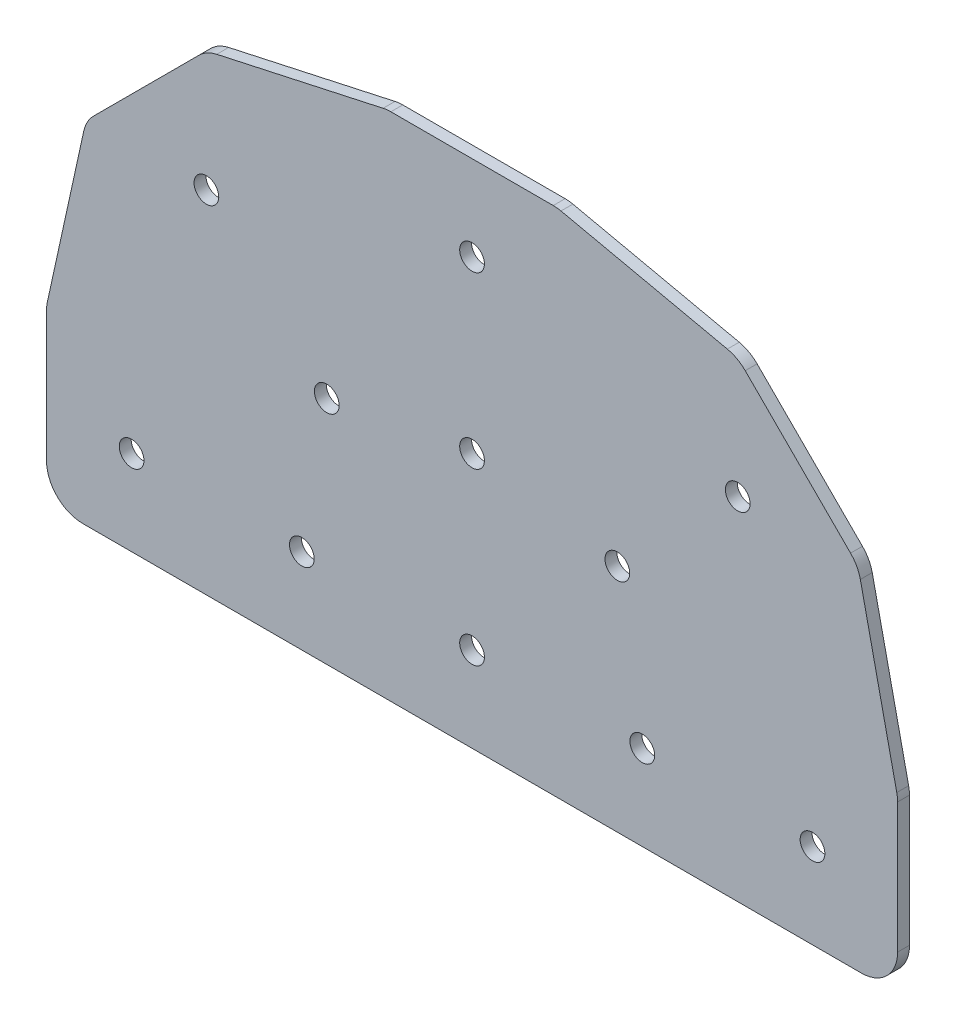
ISO-10303-21;
HEADER;
FILE_DESCRIPTION(('STEP AP214'),'2;1');
FILE_NAME('part.step','',(''),(''),'','','');
FILE_SCHEMA(('AUTOMOTIVE_DESIGN { 1 0 10303 214 1 1 1 1 }'));
ENDSEC;
DATA;
#1=APPLICATION_CONTEXT('core data for automotive mechanical design processes');
#2=APPLICATION_PROTOCOL_DEFINITION('international standard','automotive_design',2000,#1);
#3=PRODUCT_CONTEXT('',#1,'mechanical');
#4=PRODUCT('Part','Part','',(#3));
#5=PRODUCT_RELATED_PRODUCT_CATEGORY('part','',(#4));
#6=PRODUCT_DEFINITION_FORMATION('','',#4);
#7=PRODUCT_DEFINITION_CONTEXT('part definition',#1,'design');
#8=PRODUCT_DEFINITION('design','',#6,#7);
#9=PRODUCT_DEFINITION_SHAPE('','',#8);
#10=(LENGTH_UNIT() NAMED_UNIT(*) SI_UNIT(.MILLI.,.METRE.));
#11=(NAMED_UNIT(*) PLANE_ANGLE_UNIT() SI_UNIT($,.RADIAN.));
#12=(NAMED_UNIT(*) SI_UNIT($,.STERADIAN.) SOLID_ANGLE_UNIT());
#13=UNCERTAINTY_MEASURE_WITH_UNIT(LENGTH_MEASURE(1.E-05),#10,'distance_accuracy_value','');
#14=(GEOMETRIC_REPRESENTATION_CONTEXT(3) GLOBAL_UNCERTAINTY_ASSIGNED_CONTEXT((#13)) GLOBAL_UNIT_ASSIGNED_CONTEXT((#10,
#11,#12)) REPRESENTATION_CONTEXT('',''));
#15=CARTESIAN_POINT('',(0.,0.,0.));
#16=DIRECTION('',(0.,0.,1.));
#17=DIRECTION('',(1.,0.,0.));
#18=AXIS2_PLACEMENT_3D('',#15,#16,#17);
#19=CARTESIAN_POINT('',(56.8325,0.,0.));
#20=DIRECTION('',(0.,0.,1.));
#21=DIRECTION('',(1.,0.,0.));
#22=AXIS2_PLACEMENT_3D('',#19,#20,#21);
#23=PLANE('',#22);
#24=CARTESIAN_POINT('',(51.990625,4.841875,0.));
#25=DIRECTION('',(0.,0.,-1.));
#26=DIRECTION('',(-1.,0.,0.));
#27=AXIS2_PLACEMENT_3D('',#24,#25,#26);
#28=CIRCLE('',#27,4.841875);
#29=CARTESIAN_POINT('',(51.990625,0.,0.));
#30=VERTEX_POINT('',#29);
#31=CARTESIAN_POINT('',(56.8325,4.841875,0.));
#32=VERTEX_POINT('',#31);
#33=EDGE_CURVE('E158',#30,#32,#28,.F.);
#34=ORIENTED_EDGE('',*,*,#33,.F.);
#35=DIRECTION('',(1.,0.,0.));
#36=VECTOR('',#35,1.);
#37=CARTESIAN_POINT('',(-56.8325,0.,0.));
#38=LINE('',#37,#36);
#39=CARTESIAN_POINT('',(-51.990625,0.,0.));
#40=VERTEX_POINT('',#39);
#41=EDGE_CURVE('E150',#30,#40,#38,.F.);
#42=ORIENTED_EDGE('',*,*,#41,.T.);
#43=CARTESIAN_POINT('',(-51.990625,4.841875,0.));
#44=DIRECTION('',(0.,0.,-1.));
#45=DIRECTION('',(-1.,0.,0.));
#46=AXIS2_PLACEMENT_3D('',#43,#44,#45);
#47=CIRCLE('',#46,4.841875);
#48=CARTESIAN_POINT('',(-56.8325,4.841875,0.));
#49=VERTEX_POINT('',#48);
#50=EDGE_CURVE('E284',#49,#40,#47,.F.);
#51=ORIENTED_EDGE('',*,*,#50,.F.);
#52=DIRECTION('',(0.,1.,0.));
#53=VECTOR('',#52,1.);
#54=CARTESIAN_POINT('',(-56.8325,22.733,0.));
#55=LINE('',#54,#53);
#56=CARTESIAN_POINT('',(-56.8325,22.2091372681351,0.));
#57=VERTEX_POINT('',#56);
#58=EDGE_CURVE('E185',#49,#57,#55,.T.);
#59=ORIENTED_EDGE('',*,*,#58,.T.);
#60=CARTESIAN_POINT('',(-51.990625,22.2091372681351,0.));
#61=DIRECTION('',(0.,0.,-1.));
#62=DIRECTION('',(-1.,0.,0.));
#63=AXIS2_PLACEMENT_3D('',#60,#61,#62);
#64=CIRCLE('',#63,4.841875);
#65=CARTESIAN_POINT('',(-56.7204538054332,23.2447399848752,0.));
#66=VERTEX_POINT('',#65);
#67=EDGE_CURVE('E188',#66,#57,#64,.F.);
#68=ORIENTED_EDGE('',*,*,#67,.F.);
#69=DIRECTION('',(0.213884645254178,0.976858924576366,0.));
#70=VECTOR('',#69,1.);
#71=CARTESIAN_POINT('',(-51.5531461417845,46.8449876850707,0.));
#72=LINE('',#71,#70);
#73=CARTESIAN_POINT('',(-51.8564671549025,45.4596529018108,0.));
#74=VERTEX_POINT('',#73);
#75=EDGE_CURVE('E189',#66,#74,#72,.T.);
#76=ORIENTED_EDGE('',*,*,#75,.T.);
#77=CARTESIAN_POINT('',(-47.1266383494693,44.4240501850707,0.));
#78=DIRECTION('',(0.,0.,-1.));
#79=DIRECTION('',(-1.,0.,0.));
#80=AXIS2_PLACEMENT_3D('',#77,#78,#79);
#81=CIRCLE('',#80,4.841875);
#82=CARTESIAN_POINT('',(-50.5503609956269,47.8477728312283,0.));
#83=VERTEX_POINT('',#82);
#84=EDGE_CURVE('E192',#83,#74,#81,.F.);
#85=ORIENTED_EDGE('',*,*,#84,.F.);
#86=DIRECTION('',(0.707106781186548,0.707106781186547,0.));
#87=VECTOR('',#86,1.);
#88=CARTESIAN_POINT('',(-51.5531461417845,46.8449876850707,0.));
#89=LINE('',#88,#87);
#90=CARTESIAN_POINT('',(-36.4812728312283,61.9168609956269,0.));
#91=VERTEX_POINT('',#90);
#92=EDGE_CURVE('E193',#83,#91,#89,.T.);
#93=ORIENTED_EDGE('',*,*,#92,.T.);
#94=CARTESIAN_POINT('',(-33.0575501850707,58.4931383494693,0.));
#95=DIRECTION('',(0.,0.,-1.));
#96=DIRECTION('',(-1.,0.,0.));
#97=AXIS2_PLACEMENT_3D('',#94,#95,#96);
#98=CIRCLE('',#97,4.841875);
#99=CARTESIAN_POINT('',(-34.0931529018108,63.2229671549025,0.));
#100=VERTEX_POINT('',#99);
#101=EDGE_CURVE('E196',#100,#91,#98,.F.);
#102=ORIENTED_EDGE('',*,*,#101,.F.);
#103=DIRECTION('',(0.976858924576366,0.213884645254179,0.));
#104=VECTOR('',#103,1.);
#105=CARTESIAN_POINT('',(-35.4784876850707,62.9196461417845,0.));
#106=LINE('',#105,#104);
#107=CARTESIAN_POINT('',(-11.8782399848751,68.0869538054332,0.));
#108=VERTEX_POINT('',#107);
#109=EDGE_CURVE('E197',#100,#108,#106,.T.);
#110=ORIENTED_EDGE('',*,*,#109,.T.);
#111=CARTESIAN_POINT('',(-10.8426372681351,63.357125,0.));
#112=DIRECTION('',(0.,0.,-1.));
#113=DIRECTION('',(-1.,0.,0.));
#114=AXIS2_PLACEMENT_3D('',#111,#112,#113);
#115=CIRCLE('',#114,4.841875);
#116=CARTESIAN_POINT('',(-10.8426372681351,68.199,0.));
#117=VERTEX_POINT('',#116);
#118=EDGE_CURVE('E200',#117,#108,#115,.F.);
#119=ORIENTED_EDGE('',*,*,#118,.F.);
#120=DIRECTION('',(1.,0.,0.));
#121=VECTOR('',#120,1.);
#122=CARTESIAN_POINT('',(11.3665,68.199,0.));
#123=LINE('',#122,#121);
#124=CARTESIAN_POINT('',(10.8426372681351,68.199,0.));
#125=VERTEX_POINT('',#124);
#126=EDGE_CURVE('E201',#117,#125,#123,.T.);
#127=ORIENTED_EDGE('',*,*,#126,.T.);
#128=CARTESIAN_POINT('',(10.8426372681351,63.357125,0.));
#129=DIRECTION('',(0.,0.,-1.));
#130=DIRECTION('',(-1.,0.,0.));
#131=AXIS2_PLACEMENT_3D('',#128,#129,#130);
#132=CIRCLE('',#131,4.841875);
#133=CARTESIAN_POINT('',(11.8782399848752,68.0869538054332,0.));
#134=VERTEX_POINT('',#133);
#135=EDGE_CURVE('E204',#134,#125,#132,.F.);
#136=ORIENTED_EDGE('',*,*,#135,.F.);
#137=DIRECTION('',(0.976858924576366,-0.21388464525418,0.));
#138=VECTOR('',#137,1.);
#139=CARTESIAN_POINT('',(35.4784876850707,62.9196461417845,0.));
#140=LINE('',#139,#138);
#141=CARTESIAN_POINT('',(34.0931529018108,63.2229671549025,0.));
#142=VERTEX_POINT('',#141);
#143=EDGE_CURVE('E205',#134,#142,#140,.T.);
#144=ORIENTED_EDGE('',*,*,#143,.T.);
#145=CARTESIAN_POINT('',(33.0575501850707,58.4931383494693,0.));
#146=DIRECTION('',(0.,0.,-1.));
#147=DIRECTION('',(-1.,0.,0.));
#148=AXIS2_PLACEMENT_3D('',#145,#146,#147);
#149=CIRCLE('',#148,4.841875);
#150=CARTESIAN_POINT('',(36.4812728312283,61.9168609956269,0.));
#151=VERTEX_POINT('',#150);
#152=EDGE_CURVE('E208',#151,#142,#149,.F.);
#153=ORIENTED_EDGE('',*,*,#152,.F.);
#154=DIRECTION('',(0.707106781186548,-0.707106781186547,0.));
#155=VECTOR('',#154,1.);
#156=CARTESIAN_POINT('',(51.5531461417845,46.8449876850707,0.));
#157=LINE('',#156,#155);
#158=CARTESIAN_POINT('',(50.5503609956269,47.8477728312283,0.));
#159=VERTEX_POINT('',#158);
#160=EDGE_CURVE('E209',#151,#159,#157,.T.);
#161=ORIENTED_EDGE('',*,*,#160,.T.);
#162=CARTESIAN_POINT('',(47.1266383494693,44.4240501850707,0.));
#163=DIRECTION('',(0.,0.,-1.));
#164=DIRECTION('',(-1.,0.,0.));
#165=AXIS2_PLACEMENT_3D('',#162,#163,#164);
#166=CIRCLE('',#165,4.841875);
#167=CARTESIAN_POINT('',(51.8564671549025,45.4596529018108,0.));
#168=VERTEX_POINT('',#167);
#169=EDGE_CURVE('E212',#168,#159,#166,.F.);
#170=ORIENTED_EDGE('',*,*,#169,.F.);
#171=DIRECTION('',(0.213884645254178,-0.976858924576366,0.));
#172=VECTOR('',#171,1.);
#173=CARTESIAN_POINT('',(51.5531461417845,46.8449876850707,0.));
#174=LINE('',#173,#172);
#175=CARTESIAN_POINT('',(56.7204538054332,23.2447399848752,0.));
#176=VERTEX_POINT('',#175);
#177=EDGE_CURVE('E213',#168,#176,#174,.T.);
#178=ORIENTED_EDGE('',*,*,#177,.T.);
#179=CARTESIAN_POINT('',(51.990625,22.2091372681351,0.));
#180=DIRECTION('',(0.,0.,-1.));
#181=DIRECTION('',(-1.,0.,0.));
#182=AXIS2_PLACEMENT_3D('',#179,#180,#181);
#183=CIRCLE('',#182,4.841875);
#184=CARTESIAN_POINT('',(56.8325,22.2091372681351,0.));
#185=VERTEX_POINT('',#184);
#186=EDGE_CURVE('E161',#185,#176,#183,.F.);
#187=ORIENTED_EDGE('',*,*,#186,.F.);
#188=DIRECTION('',(0.,1.,0.));
#189=VECTOR('',#188,1.);
#190=CARTESIAN_POINT('',(56.8325,22.733,0.));
#191=LINE('',#190,#189);
#192=EDGE_CURVE('E155',#185,#32,#191,.F.);
#193=ORIENTED_EDGE('',*,*,#192,.T.);
#194=EDGE_LOOP('',(#34,#42,#51,#59,#68,#76,#85,#93,#102,#110,#119,#127,#136,#144,#153,#161,#170,
#178,#187,#193));
#195=FACE_BOUND('',#194,.T.);
#196=CARTESIAN_POINT('',(22.733,11.3665,0.));
#197=DIRECTION('',(0.,0.,1.));
#198=DIRECTION('',(1.,0.,0.));
#199=AXIS2_PLACEMENT_3D('',#196,#197,#198);
#200=CIRCLE('',#199,1.651);
#201=CARTESIAN_POINT('',(24.384,11.3665,0.));
#202=VERTEX_POINT('',#201);
#203=EDGE_CURVE('E184',#202,#202,#200,.T.);
#204=ORIENTED_EDGE('',*,*,#203,.T.);
#205=EDGE_LOOP('',(#204));
#206=FACE_BOUND('',#205,.T.);
#207=CARTESIAN_POINT('',(-22.733,11.3665,0.));
#208=DIRECTION('',(0.,0.,1.));
#209=DIRECTION('',(1.,0.,0.));
#210=AXIS2_PLACEMENT_3D('',#207,#208,#209);
#211=CIRCLE('',#210,1.651);
#212=CARTESIAN_POINT('',(-21.082,11.3665,0.));
#213=VERTEX_POINT('',#212);
#214=EDGE_CURVE('E311',#213,#213,#211,.T.);
#215=ORIENTED_EDGE('',*,*,#214,.T.);
#216=EDGE_LOOP('',(#215));
#217=FACE_BOUND('',#216,.T.);
#218=CARTESIAN_POINT('',(-19.4038292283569,30.770329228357,0.));
#219=DIRECTION('',(0.,0.,1.));
#220=DIRECTION('',(1.,0.,0.));
#221=AXIS2_PLACEMENT_3D('',#218,#219,#220);
#222=CIRCLE('',#221,1.651);
#223=CARTESIAN_POINT('',(-17.7528292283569,30.770329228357,0.));
#224=VERTEX_POINT('',#223);
#225=EDGE_CURVE('E314',#224,#224,#222,.T.);
#226=ORIENTED_EDGE('',*,*,#225,.T.);
#227=EDGE_LOOP('',(#226));
#228=FACE_BOUND('',#227,.T.);
#229=CARTESIAN_POINT('',(-35.4784876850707,46.8449876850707,0.));
#230=DIRECTION('',(0.,0.,1.));
#231=DIRECTION('',(1.,0.,0.));
#232=AXIS2_PLACEMENT_3D('',#229,#230,#231);
#233=CIRCLE('',#232,1.651);
#234=CARTESIAN_POINT('',(-33.8274876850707,46.8449876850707,0.));
#235=VERTEX_POINT('',#234);
#236=EDGE_CURVE('E317',#235,#235,#233,.T.);
#237=ORIENTED_EDGE('',*,*,#236,.T.);
#238=EDGE_LOOP('',(#237));
#239=FACE_BOUND('',#238,.T.);
#240=CARTESIAN_POINT('',(19.4038292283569,30.7703292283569,0.));
#241=DIRECTION('',(0.,0.,1.));
#242=DIRECTION('',(1.,0.,0.));
#243=AXIS2_PLACEMENT_3D('',#240,#241,#242);
#244=CIRCLE('',#243,1.651);
#245=CARTESIAN_POINT('',(21.0548292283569,30.7703292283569,0.));
#246=VERTEX_POINT('',#245);
#247=EDGE_CURVE('E320',#246,#246,#244,.T.);
#248=ORIENTED_EDGE('',*,*,#247,.T.);
#249=EDGE_LOOP('',(#248));
#250=FACE_BOUND('',#249,.T.);
#251=CARTESIAN_POINT('',(35.4784876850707,46.8449876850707,0.));
#252=DIRECTION('',(0.,0.,1.));
#253=DIRECTION('',(1.,0.,0.));
#254=AXIS2_PLACEMENT_3D('',#251,#252,#253);
#255=CIRCLE('',#254,1.651);
#256=CARTESIAN_POINT('',(37.1294876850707,46.8449876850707,0.));
#257=VERTEX_POINT('',#256);
#258=EDGE_CURVE('E323',#257,#257,#255,.T.);
#259=ORIENTED_EDGE('',*,*,#258,.T.);
#260=EDGE_LOOP('',(#259));
#261=FACE_BOUND('',#260,.T.);
#262=CARTESIAN_POINT('',(45.466,11.3665,0.));
#263=DIRECTION('',(0.,0.,1.));
#264=DIRECTION('',(1.,0.,0.));
#265=AXIS2_PLACEMENT_3D('',#262,#263,#264);
#266=CIRCLE('',#265,1.651);
#267=CARTESIAN_POINT('',(47.117,11.3665,0.));
#268=VERTEX_POINT('',#267);
#269=EDGE_CURVE('E326',#268,#268,#266,.T.);
#270=ORIENTED_EDGE('',*,*,#269,.T.);
#271=EDGE_LOOP('',(#270));
#272=FACE_BOUND('',#271,.T.);
#273=CARTESIAN_POINT('',(-45.466,11.3665,0.));
#274=DIRECTION('',(0.,0.,1.));
#275=DIRECTION('',(1.,0.,0.));
#276=AXIS2_PLACEMENT_3D('',#273,#274,#275);
#277=CIRCLE('',#276,1.651);
#278=CARTESIAN_POINT('',(-43.815,11.3665,0.));
#279=VERTEX_POINT('',#278);
#280=EDGE_CURVE('E329',#279,#279,#277,.T.);
#281=ORIENTED_EDGE('',*,*,#280,.T.);
#282=EDGE_LOOP('',(#281));
#283=FACE_BOUND('',#282,.T.);
#284=CARTESIAN_POINT('',(0.,34.0995,0.));
#285=DIRECTION('',(0.,0.,1.));
#286=DIRECTION('',(1.,0.,0.));
#287=AXIS2_PLACEMENT_3D('',#284,#285,#286);
#288=CIRCLE('',#287,1.651);
#289=CARTESIAN_POINT('',(1.65100000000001,34.0995,0.));
#290=VERTEX_POINT('',#289);
#291=EDGE_CURVE('E332',#290,#290,#288,.T.);
#292=ORIENTED_EDGE('',*,*,#291,.T.);
#293=EDGE_LOOP('',(#292));
#294=FACE_BOUND('',#293,.T.);
#295=CARTESIAN_POINT('',(0.,56.8325,0.));
#296=DIRECTION('',(0.,0.,1.));
#297=DIRECTION('',(1.,0.,0.));
#298=AXIS2_PLACEMENT_3D('',#295,#296,#297);
#299=CIRCLE('',#298,1.651);
#300=CARTESIAN_POINT('',(1.65100000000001,56.8325,0.));
#301=VERTEX_POINT('',#300);
#302=EDGE_CURVE('E334',#301,#301,#299,.T.);
#303=ORIENTED_EDGE('',*,*,#302,.T.);
#304=EDGE_LOOP('',(#303));
#305=FACE_BOUND('',#304,.T.);
#306=CARTESIAN_POINT('',(0.,11.3665,0.));
#307=DIRECTION('',(0.,0.,1.));
#308=DIRECTION('',(1.,0.,0.));
#309=AXIS2_PLACEMENT_3D('',#306,#307,#308);
#310=CIRCLE('',#309,1.651);
#311=CARTESIAN_POINT('',(1.65100000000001,11.3665,0.));
#312=VERTEX_POINT('',#311);
#313=EDGE_CURVE('E20',#312,#312,#310,.T.);
#314=ORIENTED_EDGE('',*,*,#313,.T.);
#315=EDGE_LOOP('',(#314));
#316=FACE_BOUND('',#315,.T.);
#317=ADVANCED_FACE('F17',(#195,#206,#217,#228,#239,#250,#261,#272,#283,#294,#305,#316),#23,.F.);
#318=CARTESIAN_POINT('',(0.,11.3665,1.5875));
#319=DIRECTION('',(0.,0.,1.));
#320=DIRECTION('',(1.,0.,0.));
#321=AXIS2_PLACEMENT_3D('',#318,#319,#320);
#322=CYLINDRICAL_SURFACE('',#321,1.651);
#323=CARTESIAN_POINT('',(0.,11.3665,1.5875));
#324=DIRECTION('',(0.,0.,1.));
#325=DIRECTION('',(1.,0.,0.));
#326=AXIS2_PLACEMENT_3D('',#323,#324,#325);
#327=CIRCLE('',#326,1.651);
#328=CARTESIAN_POINT('',(1.65100000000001,11.3665,1.5875));
#329=VERTEX_POINT('',#328);
#330=EDGE_CURVE('E280',#329,#329,#327,.F.);
#331=ORIENTED_EDGE('',*,*,#330,.F.);
#332=EDGE_LOOP('',(#331));
#333=FACE_BOUND('',#332,.T.);
#334=ORIENTED_EDGE('',*,*,#313,.F.);
#335=EDGE_LOOP('',(#334));
#336=FACE_BOUND('',#335,.T.);
#337=ADVANCED_FACE('F342',(#333,#336),#322,.F.);
#338=CARTESIAN_POINT('',(0.,56.8325,1.5875));
#339=DIRECTION('',(0.,0.,1.));
#340=DIRECTION('',(1.,0.,0.));
#341=AXIS2_PLACEMENT_3D('',#338,#339,#340);
#342=CYLINDRICAL_SURFACE('',#341,1.651);
#343=CARTESIAN_POINT('',(0.,56.8325,1.5875));
#344=DIRECTION('',(0.,0.,1.));
#345=DIRECTION('',(1.,0.,0.));
#346=AXIS2_PLACEMENT_3D('',#343,#344,#345);
#347=CIRCLE('',#346,1.651);
#348=CARTESIAN_POINT('',(1.65100000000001,56.8325,1.5875));
#349=VERTEX_POINT('',#348);
#350=EDGE_CURVE('E277',#349,#349,#347,.F.);
#351=ORIENTED_EDGE('',*,*,#350,.F.);
#352=EDGE_LOOP('',(#351));
#353=FACE_BOUND('',#352,.T.);
#354=ORIENTED_EDGE('',*,*,#302,.F.);
#355=EDGE_LOOP('',(#354));
#356=FACE_BOUND('',#355,.T.);
#357=ADVANCED_FACE('F344',(#353,#356),#342,.F.);
#358=CARTESIAN_POINT('',(0.,34.0995,1.5875));
#359=DIRECTION('',(0.,0.,1.));
#360=DIRECTION('',(1.,0.,0.));
#361=AXIS2_PLACEMENT_3D('',#358,#359,#360);
#362=CYLINDRICAL_SURFACE('',#361,1.651);
#363=CARTESIAN_POINT('',(0.,34.0995,1.5875));
#364=DIRECTION('',(0.,0.,1.));
#365=DIRECTION('',(1.,0.,0.));
#366=AXIS2_PLACEMENT_3D('',#363,#364,#365);
#367=CIRCLE('',#366,1.651);
#368=CARTESIAN_POINT('',(1.65100000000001,34.0995,1.5875));
#369=VERTEX_POINT('',#368);
#370=EDGE_CURVE('E274',#369,#369,#367,.F.);
#371=ORIENTED_EDGE('',*,*,#370,.F.);
#372=EDGE_LOOP('',(#371));
#373=FACE_BOUND('',#372,.T.);
#374=ORIENTED_EDGE('',*,*,#291,.F.);
#375=EDGE_LOOP('',(#374));
#376=FACE_BOUND('',#375,.T.);
#377=ADVANCED_FACE('F351',(#373,#376),#362,.F.);
#378=CARTESIAN_POINT('',(-45.466,11.3665,1.5875));
#379=DIRECTION('',(0.,0.,1.));
#380=DIRECTION('',(1.,0.,0.));
#381=AXIS2_PLACEMENT_3D('',#378,#379,#380);
#382=CYLINDRICAL_SURFACE('',#381,1.651);
#383=CARTESIAN_POINT('',(-45.466,11.3665,1.5875));
#384=DIRECTION('',(0.,0.,1.));
#385=DIRECTION('',(1.,0.,0.));
#386=AXIS2_PLACEMENT_3D('',#383,#384,#385);
#387=CIRCLE('',#386,1.651);
#388=CARTESIAN_POINT('',(-43.815,11.3665,1.5875));
#389=VERTEX_POINT('',#388);
#390=EDGE_CURVE('E271',#389,#389,#387,.F.);
#391=ORIENTED_EDGE('',*,*,#390,.F.);
#392=EDGE_LOOP('',(#391));
#393=FACE_BOUND('',#392,.T.);
#394=ORIENTED_EDGE('',*,*,#280,.F.);
#395=EDGE_LOOP('',(#394));
#396=FACE_BOUND('',#395,.T.);
#397=ADVANCED_FACE('F465',(#393,#396),#382,.F.);
#398=CARTESIAN_POINT('',(45.466,11.3665,1.5875));
#399=DIRECTION('',(0.,0.,1.));
#400=DIRECTION('',(1.,0.,0.));
#401=AXIS2_PLACEMENT_3D('',#398,#399,#400);
#402=CYLINDRICAL_SURFACE('',#401,1.651);
#403=CARTESIAN_POINT('',(45.466,11.3665,1.5875));
#404=DIRECTION('',(0.,0.,1.));
#405=DIRECTION('',(1.,0.,0.));
#406=AXIS2_PLACEMENT_3D('',#403,#404,#405);
#407=CIRCLE('',#406,1.651);
#408=CARTESIAN_POINT('',(47.117,11.3665,1.5875));
#409=VERTEX_POINT('',#408);
#410=EDGE_CURVE('E268',#409,#409,#407,.F.);
#411=ORIENTED_EDGE('',*,*,#410,.F.);
#412=EDGE_LOOP('',(#411));
#413=FACE_BOUND('',#412,.T.);
#414=ORIENTED_EDGE('',*,*,#269,.F.);
#415=EDGE_LOOP('',(#414));
#416=FACE_BOUND('',#415,.T.);
#417=ADVANCED_FACE('F461',(#413,#416),#402,.F.);
#418=CARTESIAN_POINT('',(35.4784876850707,46.8449876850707,1.5875));
#419=DIRECTION('',(0.,0.,1.));
#420=DIRECTION('',(1.,0.,0.));
#421=AXIS2_PLACEMENT_3D('',#418,#419,#420);
#422=CYLINDRICAL_SURFACE('',#421,1.651);
#423=CARTESIAN_POINT('',(35.4784876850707,46.8449876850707,1.5875));
#424=DIRECTION('',(0.,0.,1.));
#425=DIRECTION('',(1.,0.,0.));
#426=AXIS2_PLACEMENT_3D('',#423,#424,#425);
#427=CIRCLE('',#426,1.651);
#428=CARTESIAN_POINT('',(37.1294876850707,46.8449876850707,1.5875));
#429=VERTEX_POINT('',#428);
#430=EDGE_CURVE('E265',#429,#429,#427,.F.);
#431=ORIENTED_EDGE('',*,*,#430,.F.);
#432=EDGE_LOOP('',(#431));
#433=FACE_BOUND('',#432,.T.);
#434=ORIENTED_EDGE('',*,*,#258,.F.);
#435=EDGE_LOOP('',(#434));
#436=FACE_BOUND('',#435,.T.);
#437=ADVANCED_FACE('F457',(#433,#436),#422,.F.);
#438=CARTESIAN_POINT('',(19.4038292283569,30.7703292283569,1.5875));
#439=DIRECTION('',(0.,0.,1.));
#440=DIRECTION('',(1.,0.,0.));
#441=AXIS2_PLACEMENT_3D('',#438,#439,#440);
#442=CYLINDRICAL_SURFACE('',#441,1.651);
#443=CARTESIAN_POINT('',(19.4038292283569,30.7703292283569,1.5875));
#444=DIRECTION('',(0.,0.,1.));
#445=DIRECTION('',(1.,0.,0.));
#446=AXIS2_PLACEMENT_3D('',#443,#444,#445);
#447=CIRCLE('',#446,1.651);
#448=CARTESIAN_POINT('',(21.0548292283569,30.7703292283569,1.5875));
#449=VERTEX_POINT('',#448);
#450=EDGE_CURVE('E262',#449,#449,#447,.F.);
#451=ORIENTED_EDGE('',*,*,#450,.F.);
#452=EDGE_LOOP('',(#451));
#453=FACE_BOUND('',#452,.T.);
#454=ORIENTED_EDGE('',*,*,#247,.F.);
#455=EDGE_LOOP('',(#454));
#456=FACE_BOUND('',#455,.T.);
#457=ADVANCED_FACE('F453',(#453,#456),#442,.F.);
#458=CARTESIAN_POINT('',(-35.4784876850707,46.8449876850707,1.5875));
#459=DIRECTION('',(0.,0.,1.));
#460=DIRECTION('',(1.,0.,0.));
#461=AXIS2_PLACEMENT_3D('',#458,#459,#460);
#462=CYLINDRICAL_SURFACE('',#461,1.651);
#463=CARTESIAN_POINT('',(-35.4784876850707,46.8449876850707,1.5875));
#464=DIRECTION('',(0.,0.,1.));
#465=DIRECTION('',(1.,0.,0.));
#466=AXIS2_PLACEMENT_3D('',#463,#464,#465);
#467=CIRCLE('',#466,1.651);
#468=CARTESIAN_POINT('',(-33.8274876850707,46.8449876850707,1.5875));
#469=VERTEX_POINT('',#468);
#470=EDGE_CURVE('E259',#469,#469,#467,.F.);
#471=ORIENTED_EDGE('',*,*,#470,.F.);
#472=EDGE_LOOP('',(#471));
#473=FACE_BOUND('',#472,.T.);
#474=ORIENTED_EDGE('',*,*,#236,.F.);
#475=EDGE_LOOP('',(#474));
#476=FACE_BOUND('',#475,.T.);
#477=ADVANCED_FACE('F449',(#473,#476),#462,.F.);
#478=CARTESIAN_POINT('',(-19.4038292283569,30.770329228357,1.5875));
#479=DIRECTION('',(0.,0.,1.));
#480=DIRECTION('',(1.,0.,0.));
#481=AXIS2_PLACEMENT_3D('',#478,#479,#480);
#482=CYLINDRICAL_SURFACE('',#481,1.651);
#483=CARTESIAN_POINT('',(-19.4038292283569,30.770329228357,1.5875));
#484=DIRECTION('',(0.,0.,1.));
#485=DIRECTION('',(1.,0.,0.));
#486=AXIS2_PLACEMENT_3D('',#483,#484,#485);
#487=CIRCLE('',#486,1.651);
#488=CARTESIAN_POINT('',(-17.7528292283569,30.770329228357,1.5875));
#489=VERTEX_POINT('',#488);
#490=EDGE_CURVE('E256',#489,#489,#487,.F.);
#491=ORIENTED_EDGE('',*,*,#490,.F.);
#492=EDGE_LOOP('',(#491));
#493=FACE_BOUND('',#492,.T.);
#494=ORIENTED_EDGE('',*,*,#225,.F.);
#495=EDGE_LOOP('',(#494));
#496=FACE_BOUND('',#495,.T.);
#497=ADVANCED_FACE('F445',(#493,#496),#482,.F.);
#498=CARTESIAN_POINT('',(-22.733,11.3665,1.5875));
#499=DIRECTION('',(0.,0.,1.));
#500=DIRECTION('',(1.,0.,0.));
#501=AXIS2_PLACEMENT_3D('',#498,#499,#500);
#502=CYLINDRICAL_SURFACE('',#501,1.651);
#503=CARTESIAN_POINT('',(-22.733,11.3665,1.5875));
#504=DIRECTION('',(0.,0.,1.));
#505=DIRECTION('',(1.,0.,0.));
#506=AXIS2_PLACEMENT_3D('',#503,#504,#505);
#507=CIRCLE('',#506,1.651);
#508=CARTESIAN_POINT('',(-21.082,11.3665,1.5875));
#509=VERTEX_POINT('',#508);
#510=EDGE_CURVE('E253',#509,#509,#507,.F.);
#511=ORIENTED_EDGE('',*,*,#510,.F.);
#512=EDGE_LOOP('',(#511));
#513=FACE_BOUND('',#512,.T.);
#514=ORIENTED_EDGE('',*,*,#214,.F.);
#515=EDGE_LOOP('',(#514));
#516=FACE_BOUND('',#515,.T.);
#517=ADVANCED_FACE('F441',(#513,#516),#502,.F.);
#518=CARTESIAN_POINT('',(22.733,11.3665,1.5875));
#519=DIRECTION('',(0.,0.,1.));
#520=DIRECTION('',(1.,0.,0.));
#521=AXIS2_PLACEMENT_3D('',#518,#519,#520);
#522=CYLINDRICAL_SURFACE('',#521,1.651);
#523=CARTESIAN_POINT('',(22.733,11.3665,1.5875));
#524=DIRECTION('',(0.,0.,1.));
#525=DIRECTION('',(1.,0.,0.));
#526=AXIS2_PLACEMENT_3D('',#523,#524,#525);
#527=CIRCLE('',#526,1.651);
#528=CARTESIAN_POINT('',(24.384,11.3665,1.5875));
#529=VERTEX_POINT('',#528);
#530=EDGE_CURVE('E250',#529,#529,#527,.F.);
#531=ORIENTED_EDGE('',*,*,#530,.F.);
#532=EDGE_LOOP('',(#531));
#533=FACE_BOUND('',#532,.T.);
#534=ORIENTED_EDGE('',*,*,#203,.F.);
#535=EDGE_LOOP('',(#534));
#536=FACE_BOUND('',#535,.T.);
#537=ADVANCED_FACE('F438',(#533,#536),#522,.F.);
#538=CARTESIAN_POINT('',(-56.8325,0.,1.5875));
#539=DIRECTION('',(0.,1.,0.));
#540=DIRECTION('',(0.,0.,1.));
#541=AXIS2_PLACEMENT_3D('',#538,#539,#540);
#542=PLANE('',#541);
#543=DIRECTION('',(0.,0.,-1.));
#544=VECTOR('',#543,1.);
#545=CARTESIAN_POINT('',(51.990625,0.,1.5875));
#546=LINE('',#545,#544);
#547=CARTESIAN_POINT('',(51.990625,0.,1.5875));
#548=VERTEX_POINT('',#547);
#549=EDGE_CURVE('E171',#548,#30,#546,.T.);
#550=ORIENTED_EDGE('',*,*,#549,.F.);
#551=DIRECTION('',(1.,0.,0.));
#552=VECTOR('',#551,1.);
#553=CARTESIAN_POINT('',(56.8325,0.,1.5875));
#554=LINE('',#553,#552);
#555=CARTESIAN_POINT('',(-51.990625,0.,1.5875));
#556=VERTEX_POINT('',#555);
#557=EDGE_CURVE('E249',#556,#548,#554,.T.);
#558=ORIENTED_EDGE('',*,*,#557,.F.);
#559=DIRECTION('',(0.,0.,-1.));
#560=VECTOR('',#559,1.);
#561=CARTESIAN_POINT('',(-51.990625,0.,1.5875));
#562=LINE('',#561,#560);
#563=EDGE_CURVE('E283',#40,#556,#562,.F.);
#564=ORIENTED_EDGE('',*,*,#563,.F.);
#565=ORIENTED_EDGE('',*,*,#41,.F.);
#566=EDGE_LOOP('',(#550,#558,#564,#565));
#567=FACE_BOUND('',#566,.T.);
#568=ADVANCED_FACE('F435',(#567),#542,.F.);
#569=CARTESIAN_POINT('',(51.990625,4.841875,1.5875));
#570=DIRECTION('',(0.,0.,-1.));
#571=DIRECTION('',(-1.,0.,0.));
#572=AXIS2_PLACEMENT_3D('',#569,#570,#571);
#573=CYLINDRICAL_SURFACE('',#572,4.841875);
#574=ORIENTED_EDGE('',*,*,#33,.T.);
#575=DIRECTION('',(0.,0.,1.));
#576=VECTOR('',#575,1.);
#577=CARTESIAN_POINT('',(56.8325,4.841875,1.5875));
#578=LINE('',#577,#576);
#579=CARTESIAN_POINT('',(56.8325,4.841875,1.5875));
#580=VERTEX_POINT('',#579);
#581=EDGE_CURVE('E165',#32,#580,#578,.T.);
#582=ORIENTED_EDGE('',*,*,#581,.T.);
#583=CARTESIAN_POINT('',(51.990625,4.841875,1.5875));
#584=DIRECTION('',(0.,0.,-1.));
#585=DIRECTION('',(-1.,0.,0.));
#586=AXIS2_PLACEMENT_3D('',#583,#584,#585);
#587=CIRCLE('',#586,4.841875);
#588=EDGE_CURVE('E247',#548,#580,#587,.F.);
#589=ORIENTED_EDGE('',*,*,#588,.F.);
#590=ORIENTED_EDGE('',*,*,#549,.T.);
#591=EDGE_LOOP('',(#574,#582,#589,#590));
#592=FACE_BOUND('',#591,.T.);
#593=ADVANCED_FACE('F168',(#592),#573,.T.);
#594=CARTESIAN_POINT('',(56.8325,22.733,1.5875));
#595=DIRECTION('',(-1.,0.,0.));
#596=DIRECTION('',(0.,0.,1.));
#597=AXIS2_PLACEMENT_3D('',#594,#595,#596);
#598=PLANE('',#597);
#599=ORIENTED_EDGE('',*,*,#581,.F.);
#600=ORIENTED_EDGE('',*,*,#192,.F.);
#601=DIRECTION('',(0.,0.,-1.));
#602=VECTOR('',#601,1.);
#603=CARTESIAN_POINT('',(56.8325,22.2091372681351,1.5875));
#604=LINE('',#603,#602);
#605=CARTESIAN_POINT('',(56.8325,22.2091372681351,1.5875));
#606=VERTEX_POINT('',#605);
#607=EDGE_CURVE('E177',#606,#185,#604,.T.);
#608=ORIENTED_EDGE('',*,*,#607,.F.);
#609=DIRECTION('',(0.,1.,0.));
#610=VECTOR('',#609,1.);
#611=CARTESIAN_POINT('',(56.8325,0.,1.5875));
#612=LINE('',#611,#610);
#613=EDGE_CURVE('E175',#580,#606,#612,.T.);
#614=ORIENTED_EDGE('',*,*,#613,.F.);
#615=EDGE_LOOP('',(#599,#600,#608,#614));
#616=FACE_BOUND('',#615,.T.);
#617=ADVANCED_FACE('F173',(#616),#598,.F.);
#618=CARTESIAN_POINT('',(51.990625,22.2091372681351,1.5875));
#619=DIRECTION('',(0.,0.,-1.));
#620=DIRECTION('',(-1.,0.,0.));
#621=AXIS2_PLACEMENT_3D('',#618,#619,#620);
#622=CYLINDRICAL_SURFACE('',#621,4.841875);
#623=ORIENTED_EDGE('',*,*,#186,.T.);
#624=DIRECTION('',(0.,0.,1.));
#625=VECTOR('',#624,1.);
#626=CARTESIAN_POINT('',(56.7204538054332,23.2447399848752,1.5875));
#627=LINE('',#626,#625);
#628=CARTESIAN_POINT('',(56.7204538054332,23.2447399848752,1.5875));
#629=VERTEX_POINT('',#628);
#630=EDGE_CURVE('E214',#176,#629,#627,.T.);
#631=ORIENTED_EDGE('',*,*,#630,.T.);
#632=CARTESIAN_POINT('',(51.990625,22.2091372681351,1.5875));
#633=DIRECTION('',(0.,0.,-1.));
#634=DIRECTION('',(-1.,0.,0.));
#635=AXIS2_PLACEMENT_3D('',#632,#633,#634);
#636=CIRCLE('',#635,4.841875);
#637=EDGE_CURVE('E244',#606,#629,#636,.F.);
#638=ORIENTED_EDGE('',*,*,#637,.F.);
#639=ORIENTED_EDGE('',*,*,#607,.T.);
#640=EDGE_LOOP('',(#623,#631,#638,#639));
#641=FACE_BOUND('',#640,.T.);
#642=ADVANCED_FACE('F426',(#641),#622,.T.);
#643=CARTESIAN_POINT('',(51.5531461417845,46.8449876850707,1.5875));
#644=DIRECTION('',(-0.976858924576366,-0.213884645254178,0.));
#645=DIRECTION('',(0.213884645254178,-0.976858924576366,0.));
#646=AXIS2_PLACEMENT_3D('',#643,#644,#645);
#647=PLANE('',#646);
#648=ORIENTED_EDGE('',*,*,#630,.F.);
#649=ORIENTED_EDGE('',*,*,#177,.F.);
#650=DIRECTION('',(0.,0.,-1.));
#651=VECTOR('',#650,1.);
#652=CARTESIAN_POINT('',(51.8564671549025,45.4596529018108,1.5875));
#653=LINE('',#652,#651);
#654=CARTESIAN_POINT('',(51.8564671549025,45.4596529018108,1.5875));
#655=VERTEX_POINT('',#654);
#656=EDGE_CURVE('E307',#655,#168,#653,.T.);
#657=ORIENTED_EDGE('',*,*,#656,.F.);
#658=DIRECTION('',(-0.213884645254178,0.976858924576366,0.));
#659=VECTOR('',#658,1.);
#660=CARTESIAN_POINT('',(56.7204538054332,23.2447399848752,1.5875));
#661=LINE('',#660,#659);
#662=EDGE_CURVE('E243',#629,#655,#661,.T.);
#663=ORIENTED_EDGE('',*,*,#662,.F.);
#664=EDGE_LOOP('',(#648,#649,#657,#663));
#665=FACE_BOUND('',#664,.T.);
#666=ADVANCED_FACE('F422',(#665),#647,.F.);
#667=CARTESIAN_POINT('',(47.1266383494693,44.4240501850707,1.5875));
#668=DIRECTION('',(0.,0.,-1.));
#669=DIRECTION('',(-1.,0.,0.));
#670=AXIS2_PLACEMENT_3D('',#667,#668,#669);
#671=CYLINDRICAL_SURFACE('',#670,4.841875);
#672=ORIENTED_EDGE('',*,*,#169,.T.);
#673=DIRECTION('',(0.,0.,1.));
#674=VECTOR('',#673,1.);
#675=CARTESIAN_POINT('',(50.5503609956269,47.8477728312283,1.5875));
#676=LINE('',#675,#674);
#677=CARTESIAN_POINT('',(50.5503609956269,47.8477728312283,1.5875));
#678=VERTEX_POINT('',#677);
#679=EDGE_CURVE('E211',#159,#678,#676,.T.);
#680=ORIENTED_EDGE('',*,*,#679,.T.);
#681=CARTESIAN_POINT('',(47.1266383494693,44.4240501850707,1.5875));
#682=DIRECTION('',(0.,0.,-1.));
#683=DIRECTION('',(-1.,0.,0.));
#684=AXIS2_PLACEMENT_3D('',#681,#682,#683);
#685=CIRCLE('',#684,4.841875);
#686=EDGE_CURVE('E240',#655,#678,#685,.F.);
#687=ORIENTED_EDGE('',*,*,#686,.F.);
#688=ORIENTED_EDGE('',*,*,#656,.T.);
#689=EDGE_LOOP('',(#672,#680,#687,#688));
#690=FACE_BOUND('',#689,.T.);
#691=ADVANCED_FACE('F418',(#690),#671,.T.);
#692=CARTESIAN_POINT('',(51.5531461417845,46.8449876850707,1.5875));
#693=DIRECTION('',(-0.707106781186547,-0.707106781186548,0.));
#694=DIRECTION('',(0.707106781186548,-0.707106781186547,0.));
#695=AXIS2_PLACEMENT_3D('',#692,#693,#694);
#696=PLANE('',#695);
#697=ORIENTED_EDGE('',*,*,#679,.F.);
#698=ORIENTED_EDGE('',*,*,#160,.F.);
#699=DIRECTION('',(0.,0.,-1.));
#700=VECTOR('',#699,1.);
#701=CARTESIAN_POINT('',(36.4812728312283,61.9168609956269,1.5875));
#702=LINE('',#701,#700);
#703=CARTESIAN_POINT('',(36.4812728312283,61.9168609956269,1.5875));
#704=VERTEX_POINT('',#703);
#705=EDGE_CURVE('E304',#704,#151,#702,.T.);
#706=ORIENTED_EDGE('',*,*,#705,.F.);
#707=DIRECTION('',(-0.707106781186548,0.707106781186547,0.));
#708=VECTOR('',#707,1.);
#709=CARTESIAN_POINT('',(50.5503609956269,47.8477728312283,1.5875));
#710=LINE('',#709,#708);
#711=EDGE_CURVE('E239',#678,#704,#710,.T.);
#712=ORIENTED_EDGE('',*,*,#711,.F.);
#713=EDGE_LOOP('',(#697,#698,#706,#712));
#714=FACE_BOUND('',#713,.T.);
#715=ADVANCED_FACE('F414',(#714),#696,.F.);
#716=CARTESIAN_POINT('',(33.0575501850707,58.4931383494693,1.5875));
#717=DIRECTION('',(0.,0.,-1.));
#718=DIRECTION('',(-1.,0.,0.));
#719=AXIS2_PLACEMENT_3D('',#716,#717,#718);
#720=CYLINDRICAL_SURFACE('',#719,4.841875);
#721=ORIENTED_EDGE('',*,*,#152,.T.);
#722=DIRECTION('',(0.,0.,1.));
#723=VECTOR('',#722,1.);
#724=CARTESIAN_POINT('',(34.0931529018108,63.2229671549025,1.5875));
#725=LINE('',#724,#723);
#726=CARTESIAN_POINT('',(34.0931529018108,63.2229671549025,1.5875));
#727=VERTEX_POINT('',#726);
#728=EDGE_CURVE('E207',#142,#727,#725,.T.);
#729=ORIENTED_EDGE('',*,*,#728,.T.);
#730=CARTESIAN_POINT('',(33.0575501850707,58.4931383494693,1.5875));
#731=DIRECTION('',(0.,0.,-1.));
#732=DIRECTION('',(-1.,0.,0.));
#733=AXIS2_PLACEMENT_3D('',#730,#731,#732);
#734=CIRCLE('',#733,4.841875);
#735=EDGE_CURVE('E236',#704,#727,#734,.F.);
#736=ORIENTED_EDGE('',*,*,#735,.F.);
#737=ORIENTED_EDGE('',*,*,#705,.T.);
#738=EDGE_LOOP('',(#721,#729,#736,#737));
#739=FACE_BOUND('',#738,.T.);
#740=ADVANCED_FACE('F410',(#739),#720,.T.);
#741=CARTESIAN_POINT('',(35.4784876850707,62.9196461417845,1.5875));
#742=DIRECTION('',(-0.21388464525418,-0.976858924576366,0.));
#743=DIRECTION('',(0.976858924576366,-0.21388464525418,0.));
#744=AXIS2_PLACEMENT_3D('',#741,#742,#743);
#745=PLANE('',#744);
#746=ORIENTED_EDGE('',*,*,#728,.F.);
#747=ORIENTED_EDGE('',*,*,#143,.F.);
#748=DIRECTION('',(0.,0.,-1.));
#749=VECTOR('',#748,1.);
#750=CARTESIAN_POINT('',(11.8782399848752,68.0869538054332,1.5875));
#751=LINE('',#750,#749);
#752=CARTESIAN_POINT('',(11.8782399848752,68.0869538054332,1.5875));
#753=VERTEX_POINT('',#752);
#754=EDGE_CURVE('E301',#753,#134,#751,.T.);
#755=ORIENTED_EDGE('',*,*,#754,.F.);
#756=DIRECTION('',(-0.976858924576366,0.213884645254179,0.));
#757=VECTOR('',#756,1.);
#758=CARTESIAN_POINT('',(34.0931529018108,63.2229671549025,1.5875));
#759=LINE('',#758,#757);
#760=EDGE_CURVE('E235',#727,#753,#759,.T.);
#761=ORIENTED_EDGE('',*,*,#760,.F.);
#762=EDGE_LOOP('',(#746,#747,#755,#761));
#763=FACE_BOUND('',#762,.T.);
#764=ADVANCED_FACE('F406',(#763),#745,.F.);
#765=CARTESIAN_POINT('',(10.8426372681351,63.357125,1.5875));
#766=DIRECTION('',(0.,0.,-1.));
#767=DIRECTION('',(-1.,0.,0.));
#768=AXIS2_PLACEMENT_3D('',#765,#766,#767);
#769=CYLINDRICAL_SURFACE('',#768,4.841875);
#770=ORIENTED_EDGE('',*,*,#135,.T.);
#771=DIRECTION('',(0.,0.,1.));
#772=VECTOR('',#771,1.);
#773=CARTESIAN_POINT('',(10.8426372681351,68.199,1.5875));
#774=LINE('',#773,#772);
#775=CARTESIAN_POINT('',(10.8426372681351,68.199,1.5875));
#776=VERTEX_POINT('',#775);
#777=EDGE_CURVE('E203',#125,#776,#774,.T.);
#778=ORIENTED_EDGE('',*,*,#777,.T.);
#779=CARTESIAN_POINT('',(10.8426372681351,63.357125,1.5875));
#780=DIRECTION('',(0.,0.,-1.));
#781=DIRECTION('',(-1.,0.,0.));
#782=AXIS2_PLACEMENT_3D('',#779,#780,#781);
#783=CIRCLE('',#782,4.841875);
#784=EDGE_CURVE('E232',#753,#776,#783,.F.);
#785=ORIENTED_EDGE('',*,*,#784,.F.);
#786=ORIENTED_EDGE('',*,*,#754,.T.);
#787=EDGE_LOOP('',(#770,#778,#785,#786));
#788=FACE_BOUND('',#787,.T.);
#789=ADVANCED_FACE('F402',(#788),#769,.T.);
#790=CARTESIAN_POINT('',(11.3665,68.199,1.5875));
#791=DIRECTION('',(0.,-1.,0.));
#792=DIRECTION('',(1.,0.,0.));
#793=AXIS2_PLACEMENT_3D('',#790,#791,#792);
#794=PLANE('',#793);
#795=ORIENTED_EDGE('',*,*,#777,.F.);
#796=ORIENTED_EDGE('',*,*,#126,.F.);
#797=DIRECTION('',(0.,0.,-1.));
#798=VECTOR('',#797,1.);
#799=CARTESIAN_POINT('',(-10.8426372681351,68.199,1.5875));
#800=LINE('',#799,#798);
#801=CARTESIAN_POINT('',(-10.8426372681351,68.199,1.5875));
#802=VERTEX_POINT('',#801);
#803=EDGE_CURVE('E298',#802,#117,#800,.T.);
#804=ORIENTED_EDGE('',*,*,#803,.F.);
#805=DIRECTION('',(1.,0.,0.));
#806=VECTOR('',#805,1.);
#807=CARTESIAN_POINT('',(56.8325,68.199,1.5875));
#808=LINE('',#807,#806);
#809=EDGE_CURVE('E231',#776,#802,#808,.F.);
#810=ORIENTED_EDGE('',*,*,#809,.F.);
#811=EDGE_LOOP('',(#795,#796,#804,#810));
#812=FACE_BOUND('',#811,.T.);
#813=ADVANCED_FACE('F398',(#812),#794,.F.);
#814=CARTESIAN_POINT('',(-10.8426372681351,63.357125,1.5875));
#815=DIRECTION('',(0.,0.,-1.));
#816=DIRECTION('',(-1.,0.,0.));
#817=AXIS2_PLACEMENT_3D('',#814,#815,#816);
#818=CYLINDRICAL_SURFACE('',#817,4.841875);
#819=ORIENTED_EDGE('',*,*,#118,.T.);
#820=DIRECTION('',(0.,0.,1.));
#821=VECTOR('',#820,1.);
#822=CARTESIAN_POINT('',(-11.8782399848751,68.0869538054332,1.5875));
#823=LINE('',#822,#821);
#824=CARTESIAN_POINT('',(-11.8782399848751,68.0869538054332,1.5875));
#825=VERTEX_POINT('',#824);
#826=EDGE_CURVE('E199',#108,#825,#823,.T.);
#827=ORIENTED_EDGE('',*,*,#826,.T.);
#828=CARTESIAN_POINT('',(-10.8426372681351,63.357125,1.5875));
#829=DIRECTION('',(0.,0.,-1.));
#830=DIRECTION('',(-1.,0.,0.));
#831=AXIS2_PLACEMENT_3D('',#828,#829,#830);
#832=CIRCLE('',#831,4.841875);
#833=EDGE_CURVE('E228',#802,#825,#832,.F.);
#834=ORIENTED_EDGE('',*,*,#833,.F.);
#835=ORIENTED_EDGE('',*,*,#803,.T.);
#836=EDGE_LOOP('',(#819,#827,#834,#835));
#837=FACE_BOUND('',#836,.T.);
#838=ADVANCED_FACE('F394',(#837),#818,.T.);
#839=CARTESIAN_POINT('',(-35.4784876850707,62.9196461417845,1.5875));
#840=DIRECTION('',(0.213884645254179,-0.976858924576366,0.));
#841=DIRECTION('',(0.976858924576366,0.213884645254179,0.));
#842=AXIS2_PLACEMENT_3D('',#839,#840,#841);
#843=PLANE('',#842);
#844=ORIENTED_EDGE('',*,*,#826,.F.);
#845=ORIENTED_EDGE('',*,*,#109,.F.);
#846=DIRECTION('',(0.,0.,-1.));
#847=VECTOR('',#846,1.);
#848=CARTESIAN_POINT('',(-34.0931529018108,63.2229671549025,1.5875));
#849=LINE('',#848,#847);
#850=CARTESIAN_POINT('',(-34.0931529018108,63.2229671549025,1.5875));
#851=VERTEX_POINT('',#850);
#852=EDGE_CURVE('E295',#851,#100,#849,.T.);
#853=ORIENTED_EDGE('',*,*,#852,.F.);
#854=DIRECTION('',(-0.976858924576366,-0.213884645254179,0.));
#855=VECTOR('',#854,1.);
#856=CARTESIAN_POINT('',(-11.8782399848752,68.0869538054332,1.5875));
#857=LINE('',#856,#855);
#858=EDGE_CURVE('E227',#825,#851,#857,.T.);
#859=ORIENTED_EDGE('',*,*,#858,.F.);
#860=EDGE_LOOP('',(#844,#845,#853,#859));
#861=FACE_BOUND('',#860,.T.);
#862=ADVANCED_FACE('F390',(#861),#843,.F.);
#863=CARTESIAN_POINT('',(-33.0575501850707,58.4931383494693,1.5875));
#864=DIRECTION('',(0.,0.,-1.));
#865=DIRECTION('',(-1.,0.,0.));
#866=AXIS2_PLACEMENT_3D('',#863,#864,#865);
#867=CYLINDRICAL_SURFACE('',#866,4.841875);
#868=ORIENTED_EDGE('',*,*,#101,.T.);
#869=DIRECTION('',(0.,0.,1.));
#870=VECTOR('',#869,1.);
#871=CARTESIAN_POINT('',(-36.4812728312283,61.9168609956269,1.5875));
#872=LINE('',#871,#870);
#873=CARTESIAN_POINT('',(-36.4812728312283,61.9168609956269,1.5875));
#874=VERTEX_POINT('',#873);
#875=EDGE_CURVE('E195',#91,#874,#872,.T.);
#876=ORIENTED_EDGE('',*,*,#875,.T.);
#877=CARTESIAN_POINT('',(-33.0575501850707,58.4931383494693,1.5875));
#878=DIRECTION('',(0.,0.,-1.));
#879=DIRECTION('',(-1.,0.,0.));
#880=AXIS2_PLACEMENT_3D('',#877,#878,#879);
#881=CIRCLE('',#880,4.841875);
#882=EDGE_CURVE('E224',#851,#874,#881,.F.);
#883=ORIENTED_EDGE('',*,*,#882,.F.);
#884=ORIENTED_EDGE('',*,*,#852,.T.);
#885=EDGE_LOOP('',(#868,#876,#883,#884));
#886=FACE_BOUND('',#885,.T.);
#887=ADVANCED_FACE('F386',(#886),#867,.T.);
#888=CARTESIAN_POINT('',(-51.5531461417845,46.8449876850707,1.5875));
#889=DIRECTION('',(0.707106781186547,-0.707106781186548,0.));
#890=DIRECTION('',(0.707106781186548,0.707106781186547,0.));
#891=AXIS2_PLACEMENT_3D('',#888,#889,#890);
#892=PLANE('',#891);
#893=ORIENTED_EDGE('',*,*,#875,.F.);
#894=ORIENTED_EDGE('',*,*,#92,.F.);
#895=DIRECTION('',(0.,0.,-1.));
#896=VECTOR('',#895,1.);
#897=CARTESIAN_POINT('',(-50.5503609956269,47.8477728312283,1.5875));
#898=LINE('',#897,#896);
#899=CARTESIAN_POINT('',(-50.5503609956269,47.8477728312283,1.5875));
#900=VERTEX_POINT('',#899);
#901=EDGE_CURVE('E292',#900,#83,#898,.T.);
#902=ORIENTED_EDGE('',*,*,#901,.F.);
#903=DIRECTION('',(-0.707106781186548,-0.707106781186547,0.));
#904=VECTOR('',#903,1.);
#905=CARTESIAN_POINT('',(-36.4812728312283,61.9168609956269,1.5875));
#906=LINE('',#905,#904);
#907=EDGE_CURVE('E223',#874,#900,#906,.T.);
#908=ORIENTED_EDGE('',*,*,#907,.F.);
#909=EDGE_LOOP('',(#893,#894,#902,#908));
#910=FACE_BOUND('',#909,.T.);
#911=ADVANCED_FACE('F382',(#910),#892,.F.);
#912=CARTESIAN_POINT('',(-47.1266383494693,44.4240501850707,1.5875));
#913=DIRECTION('',(0.,0.,-1.));
#914=DIRECTION('',(-1.,0.,0.));
#915=AXIS2_PLACEMENT_3D('',#912,#913,#914);
#916=CYLINDRICAL_SURFACE('',#915,4.841875);
#917=ORIENTED_EDGE('',*,*,#84,.T.);
#918=DIRECTION('',(0.,0.,1.));
#919=VECTOR('',#918,1.);
#920=CARTESIAN_POINT('',(-51.8564671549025,45.4596529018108,1.5875));
#921=LINE('',#920,#919);
#922=CARTESIAN_POINT('',(-51.8564671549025,45.4596529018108,1.5875));
#923=VERTEX_POINT('',#922);
#924=EDGE_CURVE('E191',#74,#923,#921,.T.);
#925=ORIENTED_EDGE('',*,*,#924,.T.);
#926=CARTESIAN_POINT('',(-47.1266383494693,44.4240501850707,1.5875));
#927=DIRECTION('',(0.,0.,-1.));
#928=DIRECTION('',(-1.,0.,0.));
#929=AXIS2_PLACEMENT_3D('',#926,#927,#928);
#930=CIRCLE('',#929,4.841875);
#931=EDGE_CURVE('E220',#900,#923,#930,.F.);
#932=ORIENTED_EDGE('',*,*,#931,.F.);
#933=ORIENTED_EDGE('',*,*,#901,.T.);
#934=EDGE_LOOP('',(#917,#925,#932,#933));
#935=FACE_BOUND('',#934,.T.);
#936=ADVANCED_FACE('F378',(#935),#916,.T.);
#937=CARTESIAN_POINT('',(-51.5531461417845,46.8449876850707,1.5875));
#938=DIRECTION('',(0.976858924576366,-0.213884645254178,0.));
#939=DIRECTION('',(0.213884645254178,0.976858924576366,0.));
#940=AXIS2_PLACEMENT_3D('',#937,#938,#939);
#941=PLANE('',#940);
#942=ORIENTED_EDGE('',*,*,#924,.F.);
#943=ORIENTED_EDGE('',*,*,#75,.F.);
#944=DIRECTION('',(0.,0.,-1.));
#945=VECTOR('',#944,1.);
#946=CARTESIAN_POINT('',(-56.7204538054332,23.2447399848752,1.5875));
#947=LINE('',#946,#945);
#948=CARTESIAN_POINT('',(-56.7204538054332,23.2447399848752,1.5875));
#949=VERTEX_POINT('',#948);
#950=EDGE_CURVE('E289',#949,#66,#947,.T.);
#951=ORIENTED_EDGE('',*,*,#950,.F.);
#952=DIRECTION('',(-0.213884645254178,-0.976858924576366,0.));
#953=VECTOR('',#952,1.);
#954=CARTESIAN_POINT('',(-51.8564671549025,45.4596529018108,1.5875));
#955=LINE('',#954,#953);
#956=EDGE_CURVE('E219',#923,#949,#955,.T.);
#957=ORIENTED_EDGE('',*,*,#956,.F.);
#958=EDGE_LOOP('',(#942,#943,#951,#957));
#959=FACE_BOUND('',#958,.T.);
#960=ADVANCED_FACE('F374',(#959),#941,.F.);
#961=CARTESIAN_POINT('',(-51.990625,22.2091372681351,1.5875));
#962=DIRECTION('',(0.,0.,-1.));
#963=DIRECTION('',(-1.,0.,0.));
#964=AXIS2_PLACEMENT_3D('',#961,#962,#963);
#965=CYLINDRICAL_SURFACE('',#964,4.841875);
#966=ORIENTED_EDGE('',*,*,#67,.T.);
#967=DIRECTION('',(0.,0.,-1.));
#968=VECTOR('',#967,1.);
#969=CARTESIAN_POINT('',(-56.8325,22.2091372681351,1.5875));
#970=LINE('',#969,#968);
#971=CARTESIAN_POINT('',(-56.8325,22.2091372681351,1.5875));
#972=VERTEX_POINT('',#971);
#973=EDGE_CURVE('E187',#57,#972,#970,.F.);
#974=ORIENTED_EDGE('',*,*,#973,.T.);
#975=CARTESIAN_POINT('',(-51.990625,22.2091372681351,1.5875));
#976=DIRECTION('',(0.,0.,-1.));
#977=DIRECTION('',(-1.,0.,0.));
#978=AXIS2_PLACEMENT_3D('',#975,#976,#977);
#979=CIRCLE('',#978,4.841875);
#980=EDGE_CURVE('E216',#949,#972,#979,.F.);
#981=ORIENTED_EDGE('',*,*,#980,.F.);
#982=ORIENTED_EDGE('',*,*,#950,.T.);
#983=EDGE_LOOP('',(#966,#974,#981,#982));
#984=FACE_BOUND('',#983,.T.);
#985=ADVANCED_FACE('F371',(#984),#965,.T.);
#986=CARTESIAN_POINT('',(-56.8325,22.733,1.5875));
#987=DIRECTION('',(1.,0.,0.));
#988=DIRECTION('',(0.,0.,-1.));
#989=AXIS2_PLACEMENT_3D('',#986,#987,#988);
#990=PLANE('',#989);
#991=ORIENTED_EDGE('',*,*,#973,.F.);
#992=ORIENTED_EDGE('',*,*,#58,.F.);
#993=DIRECTION('',(0.,0.,-1.));
#994=VECTOR('',#993,1.);
#995=CARTESIAN_POINT('',(-56.8325,4.841875,1.5875));
#996=LINE('',#995,#994);
#997=CARTESIAN_POINT('',(-56.8325,4.841875,1.5875));
#998=VERTEX_POINT('',#997);
#999=EDGE_CURVE('E35',#998,#49,#996,.T.);
#1000=ORIENTED_EDGE('',*,*,#999,.F.);
#1001=DIRECTION('',(0.,1.,0.));
#1002=VECTOR('',#1001,1.);
#1003=CARTESIAN_POINT('',(-56.8325,0.,1.5875));
#1004=LINE('',#1003,#1002);
#1005=EDGE_CURVE('E26',#972,#998,#1004,.F.);
#1006=ORIENTED_EDGE('',*,*,#1005,.F.);
#1007=EDGE_LOOP('',(#991,#992,#1000,#1006));
#1008=FACE_BOUND('',#1007,.T.);
#1009=ADVANCED_FACE('F363',(#1008),#990,.F.);
#1010=CARTESIAN_POINT('',(-51.990625,4.841875,1.5875));
#1011=DIRECTION('',(0.,0.,-1.));
#1012=DIRECTION('',(-1.,0.,0.));
#1013=AXIS2_PLACEMENT_3D('',#1010,#1011,#1012);
#1014=CYLINDRICAL_SURFACE('',#1013,4.841875);
#1015=ORIENTED_EDGE('',*,*,#50,.T.);
#1016=ORIENTED_EDGE('',*,*,#563,.T.);
#1017=CARTESIAN_POINT('',(-51.990625,4.841875,1.5875));
#1018=DIRECTION('',(0.,0.,-1.));
#1019=DIRECTION('',(-1.,0.,0.));
#1020=AXIS2_PLACEMENT_3D('',#1017,#1018,#1019);
#1021=CIRCLE('',#1020,4.841875);
#1022=EDGE_CURVE('E10',#998,#556,#1021,.F.);
#1023=ORIENTED_EDGE('',*,*,#1022,.F.);
#1024=ORIENTED_EDGE('',*,*,#999,.T.);
#1025=EDGE_LOOP('',(#1015,#1016,#1023,#1024));
#1026=FACE_BOUND('',#1025,.T.);
#1027=ADVANCED_FACE('F357',(#1026),#1014,.T.);
#1028=CARTESIAN_POINT('',(56.8325,0.,1.5875));
#1029=DIRECTION('',(0.,0.,1.));
#1030=DIRECTION('',(1.,0.,0.));
#1031=AXIS2_PLACEMENT_3D('',#1028,#1029,#1030);
#1032=PLANE('',#1031);
#1033=ORIENTED_EDGE('',*,*,#1005,.T.);
#1034=ORIENTED_EDGE('',*,*,#1022,.T.);
#1035=ORIENTED_EDGE('',*,*,#557,.T.);
#1036=ORIENTED_EDGE('',*,*,#588,.T.);
#1037=ORIENTED_EDGE('',*,*,#613,.T.);
#1038=ORIENTED_EDGE('',*,*,#637,.T.);
#1039=ORIENTED_EDGE('',*,*,#662,.T.);
#1040=ORIENTED_EDGE('',*,*,#686,.T.);
#1041=ORIENTED_EDGE('',*,*,#711,.T.);
#1042=ORIENTED_EDGE('',*,*,#735,.T.);
#1043=ORIENTED_EDGE('',*,*,#760,.T.);
#1044=ORIENTED_EDGE('',*,*,#784,.T.);
#1045=ORIENTED_EDGE('',*,*,#809,.T.);
#1046=ORIENTED_EDGE('',*,*,#833,.T.);
#1047=ORIENTED_EDGE('',*,*,#858,.T.);
#1048=ORIENTED_EDGE('',*,*,#882,.T.);
#1049=ORIENTED_EDGE('',*,*,#907,.T.);
#1050=ORIENTED_EDGE('',*,*,#931,.T.);
#1051=ORIENTED_EDGE('',*,*,#956,.T.);
#1052=ORIENTED_EDGE('',*,*,#980,.T.);
#1053=EDGE_LOOP('',(#1033,#1034,#1035,#1036,#1037,#1038,#1039,#1040,#1041,#1042,#1043,#1044,
#1045,#1046,#1047,#1048,#1049,#1050,#1051,#1052));
#1054=FACE_BOUND('',#1053,.T.);
#1055=ORIENTED_EDGE('',*,*,#530,.T.);
#1056=EDGE_LOOP('',(#1055));
#1057=FACE_BOUND('',#1056,.T.);
#1058=ORIENTED_EDGE('',*,*,#510,.T.);
#1059=EDGE_LOOP('',(#1058));
#1060=FACE_BOUND('',#1059,.T.);
#1061=ORIENTED_EDGE('',*,*,#490,.T.);
#1062=EDGE_LOOP('',(#1061));
#1063=FACE_BOUND('',#1062,.T.);
#1064=ORIENTED_EDGE('',*,*,#470,.T.);
#1065=EDGE_LOOP('',(#1064));
#1066=FACE_BOUND('',#1065,.T.);
#1067=ORIENTED_EDGE('',*,*,#450,.T.);
#1068=EDGE_LOOP('',(#1067));
#1069=FACE_BOUND('',#1068,.T.);
#1070=ORIENTED_EDGE('',*,*,#430,.T.);
#1071=EDGE_LOOP('',(#1070));
#1072=FACE_BOUND('',#1071,.T.);
#1073=ORIENTED_EDGE('',*,*,#410,.T.);
#1074=EDGE_LOOP('',(#1073));
#1075=FACE_BOUND('',#1074,.T.);
#1076=ORIENTED_EDGE('',*,*,#390,.T.);
#1077=EDGE_LOOP('',(#1076));
#1078=FACE_BOUND('',#1077,.T.);
#1079=ORIENTED_EDGE('',*,*,#370,.T.);
#1080=EDGE_LOOP('',(#1079));
#1081=FACE_BOUND('',#1080,.T.);
#1082=ORIENTED_EDGE('',*,*,#350,.T.);
#1083=EDGE_LOOP('',(#1082));
#1084=FACE_BOUND('',#1083,.T.);
#1085=ORIENTED_EDGE('',*,*,#330,.T.);
#1086=EDGE_LOOP('',(#1085));
#1087=FACE_BOUND('',#1086,.T.);
#1088=ADVANCED_FACE('F355',(#1054,#1057,#1060,#1063,#1066,#1069,#1072,#1075,#1078,#1081,#1084,
#1087),#1032,.T.);
#1089=CLOSED_SHELL('',(#317,#337,#357,#377,#397,#417,#437,#457,#477,#497,#517,#537,#568,#593,
#617,#642,#666,#691,#715,#740,#764,#789,#813,#838,#862,#887,#911,#936,#960,#985,#1009,#1027,#1088));
#1090=MANIFOLD_SOLID_BREP('B1',#1089);
#1091=ADVANCED_BREP_SHAPE_REPRESENTATION('',(#18,#1090),#14);
#1092=SHAPE_DEFINITION_REPRESENTATION(#9,#1091);
ENDSEC;
END-ISO-10303-21;
